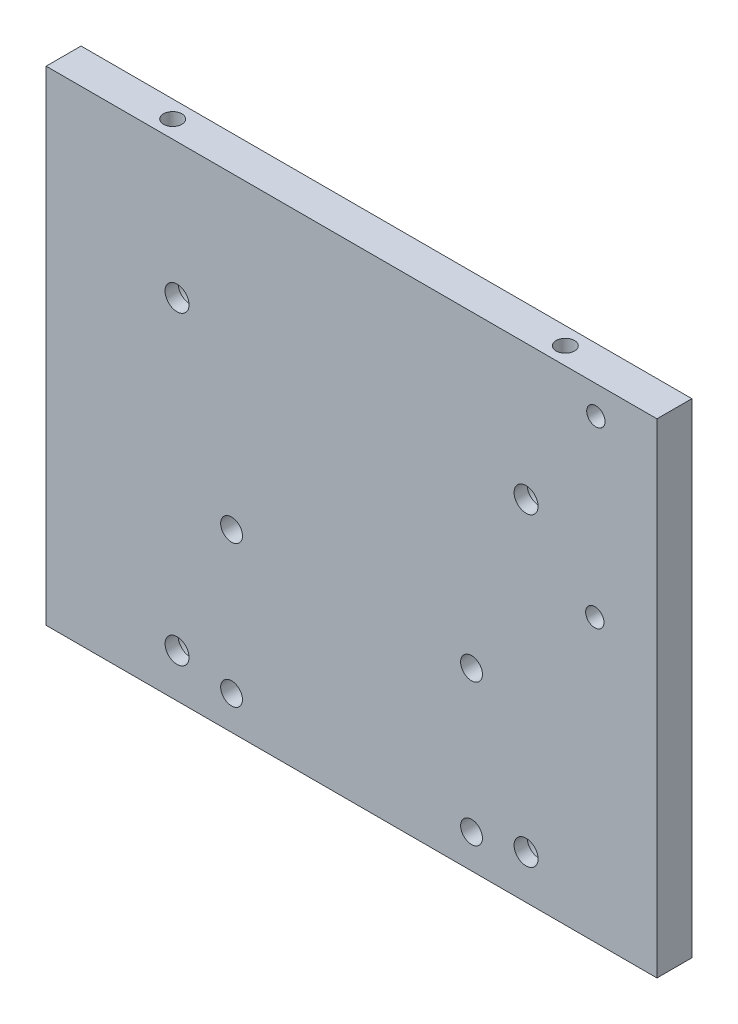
ISO-10303-21;
HEADER;
FILE_DESCRIPTION(('STEP AP214'),'2;1');
FILE_NAME('part.step','',(''),(''),'','','');
FILE_SCHEMA(('AUTOMOTIVE_DESIGN { 1 0 10303 214 1 1 1 1 }'));
ENDSEC;
DATA;
#1=APPLICATION_CONTEXT('core data for automotive mechanical design processes');
#2=APPLICATION_PROTOCOL_DEFINITION('international standard','automotive_design',2000,#1);
#3=PRODUCT_CONTEXT('',#1,'mechanical');
#4=PRODUCT('Part','Part','',(#3));
#5=PRODUCT_RELATED_PRODUCT_CATEGORY('part','',(#4));
#6=PRODUCT_DEFINITION_FORMATION('','',#4);
#7=PRODUCT_DEFINITION_CONTEXT('part definition',#1,'design');
#8=PRODUCT_DEFINITION('design','',#6,#7);
#9=PRODUCT_DEFINITION_SHAPE('','',#8);
#10=(LENGTH_UNIT() NAMED_UNIT(*) SI_UNIT(.MILLI.,.METRE.));
#11=(NAMED_UNIT(*) PLANE_ANGLE_UNIT() SI_UNIT($,.RADIAN.));
#12=(NAMED_UNIT(*) SI_UNIT($,.STERADIAN.) SOLID_ANGLE_UNIT());
#13=UNCERTAINTY_MEASURE_WITH_UNIT(LENGTH_MEASURE(1.E-05),#10,'distance_accuracy_value','');
#14=(GEOMETRIC_REPRESENTATION_CONTEXT(3) GLOBAL_UNCERTAINTY_ASSIGNED_CONTEXT((#13)) GLOBAL_UNIT_ASSIGNED_CONTEXT((#10,
#11,#12)) REPRESENTATION_CONTEXT('',''));
#15=CARTESIAN_POINT('',(0.,0.,0.));
#16=DIRECTION('',(0.,0.,1.));
#17=DIRECTION('',(1.,0.,0.));
#18=AXIS2_PLACEMENT_3D('',#15,#16,#17);
#19=CARTESIAN_POINT('',(-70.,0.,8.00000000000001));
#20=DIRECTION('',(0.,0.,1.));
#21=DIRECTION('',(1.,0.,0.));
#22=AXIS2_PLACEMENT_3D('',#19,#20,#21);
#23=PLANE('',#22);
#24=CARTESIAN_POINT('',(55.7566542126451,64.4999999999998,8.00000000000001));
#25=DIRECTION('',(0.,0.,-1.));
#26=DIRECTION('',(-1.,0.,0.));
#27=AXIS2_PLACEMENT_3D('',#24,#25,#26);
#28=CIRCLE('',#27,2.1);
#29=CARTESIAN_POINT('',(53.6566542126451,64.4999999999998,8.00000000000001));
#30=VERTEX_POINT('',#29);
#31=EDGE_CURVE('E412',#30,#30,#28,.T.);
#32=ORIENTED_EDGE('',*,*,#31,.T.);
#33=EDGE_LOOP('',(#32));
#34=FACE_BOUND('',#33,.T.);
#35=CARTESIAN_POINT('',(-40.,80.0000000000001,8.00000000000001));
#36=DIRECTION('',(0.,0.,1.));
#37=DIRECTION('',(1.,0.,0.));
#38=AXIS2_PLACEMENT_3D('',#35,#36,#37);
#39=CIRCLE('',#38,2.75);
#40=CARTESIAN_POINT('',(-37.25,80.0000000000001,8.00000000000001));
#41=VERTEX_POINT('',#40);
#42=EDGE_CURVE('E352',#41,#41,#39,.T.);
#43=ORIENTED_EDGE('',*,*,#42,.F.);
#44=EDGE_LOOP('',(#43));
#45=FACE_BOUND('',#44,.T.);
#46=CARTESIAN_POINT('',(-40.,10.,8.00000000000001));
#47=DIRECTION('',(0.,0.,1.));
#48=DIRECTION('',(1.,0.,0.));
#49=AXIS2_PLACEMENT_3D('',#46,#47,#48);
#50=CIRCLE('',#49,2.75);
#51=CARTESIAN_POINT('',(-37.25,10.,8.00000000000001));
#52=VERTEX_POINT('',#51);
#53=EDGE_CURVE('E439',#52,#52,#50,.T.);
#54=ORIENTED_EDGE('',*,*,#53,.F.);
#55=EDGE_LOOP('',(#54));
#56=FACE_BOUND('',#55,.T.);
#57=CARTESIAN_POINT('',(40.,80.0000000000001,8.00000000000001));
#58=DIRECTION('',(0.,0.,1.));
#59=DIRECTION('',(1.,0.,0.));
#60=AXIS2_PLACEMENT_3D('',#57,#58,#59);
#61=CIRCLE('',#60,2.75);
#62=CARTESIAN_POINT('',(42.75,80.0000000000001,8.00000000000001));
#63=VERTEX_POINT('',#62);
#64=EDGE_CURVE('E449',#63,#63,#61,.T.);
#65=ORIENTED_EDGE('',*,*,#64,.F.);
#66=EDGE_LOOP('',(#65));
#67=FACE_BOUND('',#66,.T.);
#68=CARTESIAN_POINT('',(40.,10.,8.00000000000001));
#69=DIRECTION('',(0.,0.,1.));
#70=DIRECTION('',(1.,0.,0.));
#71=AXIS2_PLACEMENT_3D('',#68,#69,#70);
#72=CIRCLE('',#71,2.75);
#73=CARTESIAN_POINT('',(42.75,10.,8.00000000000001));
#74=VERTEX_POINT('',#73);
#75=EDGE_CURVE('E459',#74,#74,#72,.T.);
#76=ORIENTED_EDGE('',*,*,#75,.F.);
#77=EDGE_LOOP('',(#76));
#78=FACE_BOUND('',#77,.T.);
#79=CARTESIAN_POINT('',(-27.5,40.2499999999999,8.00000000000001));
#80=DIRECTION('',(0.,0.,-1.));
#81=DIRECTION('',(-1.,0.,0.));
#82=AXIS2_PLACEMENT_3D('',#79,#80,#81);
#83=CIRCLE('',#82,2.5);
#84=CARTESIAN_POINT('',(-30.,40.2499999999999,8.00000000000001));
#85=VERTEX_POINT('',#84);
#86=EDGE_CURVE('E463',#85,#85,#83,.T.);
#87=ORIENTED_EDGE('',*,*,#86,.T.);
#88=EDGE_LOOP('',(#87));
#89=FACE_BOUND('',#88,.T.);
#90=CARTESIAN_POINT('',(-27.5,7.74999999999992,8.00000000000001));
#91=DIRECTION('',(0.,0.,-1.));
#92=DIRECTION('',(-1.,0.,0.));
#93=AXIS2_PLACEMENT_3D('',#90,#91,#92);
#94=CIRCLE('',#93,2.5);
#95=CARTESIAN_POINT('',(-30.,7.74999999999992,8.00000000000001));
#96=VERTEX_POINT('',#95);
#97=EDGE_CURVE('E469',#96,#96,#94,.T.);
#98=ORIENTED_EDGE('',*,*,#97,.T.);
#99=EDGE_LOOP('',(#98));
#100=FACE_BOUND('',#99,.T.);
#101=CARTESIAN_POINT('',(27.5,7.74999999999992,8.00000000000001));
#102=DIRECTION('',(0.,0.,-1.));
#103=DIRECTION('',(-1.,0.,0.));
#104=AXIS2_PLACEMENT_3D('',#101,#102,#103);
#105=CIRCLE('',#104,2.5);
#106=CARTESIAN_POINT('',(25.,7.74999999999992,8.00000000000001));
#107=VERTEX_POINT('',#106);
#108=EDGE_CURVE('E475',#107,#107,#105,.T.);
#109=ORIENTED_EDGE('',*,*,#108,.T.);
#110=EDGE_LOOP('',(#109));
#111=FACE_BOUND('',#110,.T.);
#112=CARTESIAN_POINT('',(27.5,40.2499999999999,8.00000000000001));
#113=DIRECTION('',(0.,0.,-1.));
#114=DIRECTION('',(-1.,0.,0.));
#115=AXIS2_PLACEMENT_3D('',#112,#113,#114);
#116=CIRCLE('',#115,2.5);
#117=CARTESIAN_POINT('',(25.,40.2499999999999,8.00000000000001));
#118=VERTEX_POINT('',#117);
#119=EDGE_CURVE('E481',#118,#118,#116,.T.);
#120=ORIENTED_EDGE('',*,*,#119,.T.);
#121=EDGE_LOOP('',(#120));
#122=FACE_BOUND('',#121,.T.);
#123=DIRECTION('',(0.,-1.,0.));
#124=VECTOR('',#123,1.);
#125=CARTESIAN_POINT('',(-70.,111.,8.00000000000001));
#126=LINE('',#125,#124);
#127=CARTESIAN_POINT('',(-70.,111.,8.00000000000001));
#128=VERTEX_POINT('',#127);
#129=CARTESIAN_POINT('',(-70.,0.,8.00000000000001));
#130=VERTEX_POINT('',#129);
#131=EDGE_CURVE('E493',#128,#130,#126,.T.);
#132=ORIENTED_EDGE('',*,*,#131,.T.);
#133=DIRECTION('',(1.,0.,0.));
#134=VECTOR('',#133,1.);
#135=CARTESIAN_POINT('',(-70.,0.,8.00000000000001));
#136=LINE('',#135,#134);
#137=CARTESIAN_POINT('',(70.,0.,8.00000000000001));
#138=VERTEX_POINT('',#137);
#139=EDGE_CURVE('E495',#130,#138,#136,.T.);
#140=ORIENTED_EDGE('',*,*,#139,.T.);
#141=DIRECTION('',(0.,1.,0.));
#142=VECTOR('',#141,1.);
#143=CARTESIAN_POINT('',(70.,111.,8.00000000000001));
#144=LINE('',#143,#142);
#145=CARTESIAN_POINT('',(70.,111.,8.00000000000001));
#146=VERTEX_POINT('',#145);
#147=EDGE_CURVE('E370',#138,#146,#144,.T.);
#148=ORIENTED_EDGE('',*,*,#147,.T.);
#149=DIRECTION('',(-1.,0.,0.));
#150=VECTOR('',#149,1.);
#151=CARTESIAN_POINT('',(-70.,111.,8.00000000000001));
#152=LINE('',#151,#150);
#153=EDGE_CURVE('E365',#146,#128,#152,.T.);
#154=ORIENTED_EDGE('',*,*,#153,.T.);
#155=EDGE_LOOP('',(#132,#140,#148,#154));
#156=FACE_BOUND('',#155,.T.);
#157=CARTESIAN_POINT('',(56.,104.5,8.00000000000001));
#158=DIRECTION('',(0.,0.,-1.));
#159=DIRECTION('',(-1.,0.,0.));
#160=AXIS2_PLACEMENT_3D('',#157,#158,#159);
#161=CIRCLE('',#160,2.1);
#162=CARTESIAN_POINT('',(53.9,104.5,8.00000000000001));
#163=VERTEX_POINT('',#162);
#164=EDGE_CURVE('E536',#163,#163,#161,.T.);
#165=ORIENTED_EDGE('',*,*,#164,.T.);
#166=EDGE_LOOP('',(#165));
#167=FACE_BOUND('',#166,.T.);
#168=ADVANCED_FACE('F348',(#34,#45,#56,#67,#78,#89,#100,#111,#122,#156,#167),#23,.T.);
#169=CARTESIAN_POINT('',(-70.,111.,8.00000000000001));
#170=DIRECTION('',(1.,0.,0.));
#171=DIRECTION('',(0.,1.,0.));
#172=AXIS2_PLACEMENT_3D('',#169,#170,#171);
#173=PLANE('',#172);
#174=DIRECTION('',(0.,-1.,0.));
#175=VECTOR('',#174,1.);
#176=CARTESIAN_POINT('',(-70.,111.,0.));
#177=LINE('',#176,#175);
#178=CARTESIAN_POINT('',(-70.,111.,0.));
#179=VERTEX_POINT('',#178);
#180=CARTESIAN_POINT('',(-70.,0.,0.));
#181=VERTEX_POINT('',#180);
#182=EDGE_CURVE('E484',#179,#181,#177,.T.);
#183=ORIENTED_EDGE('',*,*,#182,.T.);
#184=DIRECTION('',(0.,0.,-1.));
#185=VECTOR('',#184,1.);
#186=CARTESIAN_POINT('',(-70.,0.,8.00000000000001));
#187=LINE('',#186,#185);
#188=EDGE_CURVE('E11',#130,#181,#187,.T.);
#189=ORIENTED_EDGE('',*,*,#188,.F.);
#190=ORIENTED_EDGE('',*,*,#131,.F.);
#191=DIRECTION('',(0.,0.,-1.));
#192=VECTOR('',#191,1.);
#193=CARTESIAN_POINT('',(-70.,111.,8.00000000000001));
#194=LINE('',#193,#192);
#195=EDGE_CURVE('E499',#128,#179,#194,.T.);
#196=ORIENTED_EDGE('',*,*,#195,.T.);
#197=EDGE_LOOP('',(#183,#189,#190,#196));
#198=FACE_BOUND('',#197,.T.);
#199=ADVANCED_FACE('F350',(#198),#173,.F.);
#200=CARTESIAN_POINT('',(-70.,0.,8.00000000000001));
#201=DIRECTION('',(0.,1.,0.));
#202=DIRECTION('',(0.,0.,1.));
#203=AXIS2_PLACEMENT_3D('',#200,#201,#202);
#204=PLANE('',#203);
#205=DIRECTION('',(1.,0.,0.));
#206=VECTOR('',#205,1.);
#207=CARTESIAN_POINT('',(-70.,0.,0.));
#208=LINE('',#207,#206);
#209=CARTESIAN_POINT('',(70.,0.,0.));
#210=VERTEX_POINT('',#209);
#211=EDGE_CURVE('E487',#181,#210,#208,.T.);
#212=ORIENTED_EDGE('',*,*,#211,.T.);
#213=DIRECTION('',(0.,0.,-1.));
#214=VECTOR('',#213,1.);
#215=CARTESIAN_POINT('',(70.,0.,8.00000000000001));
#216=LINE('',#215,#214);
#217=EDGE_CURVE('E357',#138,#210,#216,.T.);
#218=ORIENTED_EDGE('',*,*,#217,.F.);
#219=ORIENTED_EDGE('',*,*,#139,.F.);
#220=ORIENTED_EDGE('',*,*,#188,.T.);
#221=EDGE_LOOP('',(#212,#218,#219,#220));
#222=FACE_BOUND('',#221,.T.);
#223=ADVANCED_FACE('F584',(#222),#204,.F.);
#224=CARTESIAN_POINT('',(70.,111.,8.00000000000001));
#225=DIRECTION('',(-1.,0.,0.));
#226=DIRECTION('',(0.,-1.,0.));
#227=AXIS2_PLACEMENT_3D('',#224,#225,#226);
#228=PLANE('',#227);
#229=DIRECTION('',(0.,1.,0.));
#230=VECTOR('',#229,1.);
#231=CARTESIAN_POINT('',(70.,111.,0.));
#232=LINE('',#231,#230);
#233=CARTESIAN_POINT('',(70.,111.,0.));
#234=VERTEX_POINT('',#233);
#235=EDGE_CURVE('E489',#210,#234,#232,.T.);
#236=ORIENTED_EDGE('',*,*,#235,.T.);
#237=DIRECTION('',(0.,0.,-1.));
#238=VECTOR('',#237,1.);
#239=CARTESIAN_POINT('',(70.,111.,8.00000000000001));
#240=LINE('',#239,#238);
#241=EDGE_CURVE('E502',#146,#234,#240,.T.);
#242=ORIENTED_EDGE('',*,*,#241,.F.);
#243=ORIENTED_EDGE('',*,*,#147,.F.);
#244=ORIENTED_EDGE('',*,*,#217,.T.);
#245=EDGE_LOOP('',(#236,#242,#243,#244));
#246=FACE_BOUND('',#245,.T.);
#247=ADVANCED_FACE('F581',(#246),#228,.F.);
#248=CARTESIAN_POINT('',(-70.,111.,8.00000000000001));
#249=DIRECTION('',(0.,-1.,0.));
#250=DIRECTION('',(0.,0.,-1.));
#251=AXIS2_PLACEMENT_3D('',#248,#249,#250);
#252=PLANE('',#251);
#253=CARTESIAN_POINT('',(45.,111.,4.));
#254=DIRECTION('',(0.,1.,0.));
#255=DIRECTION('',(0.,0.,1.));
#256=AXIS2_PLACEMENT_3D('',#253,#254,#255);
#257=CIRCLE('',#256,2.09999999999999);
#258=CARTESIAN_POINT('',(45.,111.,6.09999999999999));
#259=VERTEX_POINT('',#258);
#260=EDGE_CURVE('E405',#259,#259,#257,.T.);
#261=ORIENTED_EDGE('',*,*,#260,.F.);
#262=EDGE_LOOP('',(#261));
#263=FACE_BOUND('',#262,.T.);
#264=CARTESIAN_POINT('',(-45.,111.,4.));
#265=DIRECTION('',(0.,1.,0.));
#266=DIRECTION('',(0.,0.,1.));
#267=AXIS2_PLACEMENT_3D('',#264,#265,#266);
#268=CIRCLE('',#267,2.09999999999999);
#269=CARTESIAN_POINT('',(-45.,111.,6.09999999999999));
#270=VERTEX_POINT('',#269);
#271=EDGE_CURVE('E418',#270,#270,#268,.T.);
#272=ORIENTED_EDGE('',*,*,#271,.F.);
#273=EDGE_LOOP('',(#272));
#274=FACE_BOUND('',#273,.T.);
#275=DIRECTION('',(-1.,0.,0.));
#276=VECTOR('',#275,1.);
#277=CARTESIAN_POINT('',(-70.,111.,0.));
#278=LINE('',#277,#276);
#279=EDGE_CURVE('E491',#234,#179,#278,.T.);
#280=ORIENTED_EDGE('',*,*,#279,.T.);
#281=ORIENTED_EDGE('',*,*,#195,.F.);
#282=ORIENTED_EDGE('',*,*,#153,.F.);
#283=ORIENTED_EDGE('',*,*,#241,.T.);
#284=EDGE_LOOP('',(#280,#281,#282,#283));
#285=FACE_BOUND('',#284,.T.);
#286=ADVANCED_FACE('F556',(#263,#274,#285),#252,.F.);
#287=CARTESIAN_POINT('',(-70.,0.,0.));
#288=DIRECTION('',(0.,0.,1.));
#289=DIRECTION('',(1.,0.,0.));
#290=AXIS2_PLACEMENT_3D('',#287,#288,#289);
#291=PLANE('',#290);
#292=CARTESIAN_POINT('',(56.,104.5,0.));
#293=DIRECTION('',(0.,0.,-1.));
#294=DIRECTION('',(-1.,0.,0.));
#295=AXIS2_PLACEMENT_3D('',#292,#293,#294);
#296=CIRCLE('',#295,2.1);
#297=CARTESIAN_POINT('',(53.9,104.5,0.));
#298=VERTEX_POINT('',#297);
#299=EDGE_CURVE('E538',#298,#298,#296,.T.);
#300=ORIENTED_EDGE('',*,*,#299,.F.);
#301=EDGE_LOOP('',(#300));
#302=FACE_BOUND('',#301,.T.);
#303=CARTESIAN_POINT('',(55.7566542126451,64.4999999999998,0.));
#304=DIRECTION('',(0.,0.,-1.));
#305=DIRECTION('',(-1.,0.,0.));
#306=AXIS2_PLACEMENT_3D('',#303,#304,#305);
#307=CIRCLE('',#306,2.1);
#308=CARTESIAN_POINT('',(53.6566542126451,64.4999999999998,0.));
#309=VERTEX_POINT('',#308);
#310=EDGE_CURVE('E406',#309,#309,#307,.T.);
#311=ORIENTED_EDGE('',*,*,#310,.F.);
#312=EDGE_LOOP('',(#311));
#313=FACE_BOUND('',#312,.T.);
#314=CARTESIAN_POINT('',(-40.,80.0000000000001,0.));
#315=DIRECTION('',(0.,0.,-1.));
#316=DIRECTION('',(-1.,0.,0.));
#317=AXIS2_PLACEMENT_3D('',#314,#315,#316);
#318=CIRCLE('',#317,5.);
#319=CARTESIAN_POINT('',(-45.,80.0000000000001,0.));
#320=VERTEX_POINT('',#319);
#321=EDGE_CURVE('E427',#320,#320,#318,.T.);
#322=ORIENTED_EDGE('',*,*,#321,.F.);
#323=EDGE_LOOP('',(#322));
#324=FACE_BOUND('',#323,.T.);
#325=CARTESIAN_POINT('',(-40.,10.,0.));
#326=DIRECTION('',(0.,0.,-1.));
#327=DIRECTION('',(-1.,0.,0.));
#328=AXIS2_PLACEMENT_3D('',#325,#326,#327);
#329=CIRCLE('',#328,5.);
#330=CARTESIAN_POINT('',(-45.,10.,0.));
#331=VERTEX_POINT('',#330);
#332=EDGE_CURVE('E436',#331,#331,#329,.T.);
#333=ORIENTED_EDGE('',*,*,#332,.F.);
#334=EDGE_LOOP('',(#333));
#335=FACE_BOUND('',#334,.T.);
#336=CARTESIAN_POINT('',(40.,80.0000000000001,0.));
#337=DIRECTION('',(0.,0.,-1.));
#338=DIRECTION('',(-1.,0.,0.));
#339=AXIS2_PLACEMENT_3D('',#336,#337,#338);
#340=CIRCLE('',#339,5.);
#341=CARTESIAN_POINT('',(35.,80.0000000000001,0.));
#342=VERTEX_POINT('',#341);
#343=EDGE_CURVE('E446',#342,#342,#340,.T.);
#344=ORIENTED_EDGE('',*,*,#343,.F.);
#345=EDGE_LOOP('',(#344));
#346=FACE_BOUND('',#345,.T.);
#347=CARTESIAN_POINT('',(40.,10.,0.));
#348=DIRECTION('',(0.,0.,-1.));
#349=DIRECTION('',(-1.,0.,0.));
#350=AXIS2_PLACEMENT_3D('',#347,#348,#349);
#351=CIRCLE('',#350,5.);
#352=CARTESIAN_POINT('',(35.,10.,0.));
#353=VERTEX_POINT('',#352);
#354=EDGE_CURVE('E456',#353,#353,#351,.T.);
#355=ORIENTED_EDGE('',*,*,#354,.F.);
#356=EDGE_LOOP('',(#355));
#357=FACE_BOUND('',#356,.T.);
#358=CARTESIAN_POINT('',(-27.5,40.2499999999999,0.));
#359=DIRECTION('',(0.,0.,-1.));
#360=DIRECTION('',(-1.,0.,0.));
#361=AXIS2_PLACEMENT_3D('',#358,#359,#360);
#362=CIRCLE('',#361,2.49999999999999);
#363=CARTESIAN_POINT('',(-30.,40.2499999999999,0.));
#364=VERTEX_POINT('',#363);
#365=EDGE_CURVE('E460',#364,#364,#362,.T.);
#366=ORIENTED_EDGE('',*,*,#365,.F.);
#367=EDGE_LOOP('',(#366));
#368=FACE_BOUND('',#367,.T.);
#369=CARTESIAN_POINT('',(-27.5,7.74999999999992,0.));
#370=DIRECTION('',(0.,0.,-1.));
#371=DIRECTION('',(-1.,0.,0.));
#372=AXIS2_PLACEMENT_3D('',#369,#370,#371);
#373=CIRCLE('',#372,2.49999999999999);
#374=CARTESIAN_POINT('',(-30.,7.74999999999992,0.));
#375=VERTEX_POINT('',#374);
#376=EDGE_CURVE('E466',#375,#375,#373,.T.);
#377=ORIENTED_EDGE('',*,*,#376,.F.);
#378=EDGE_LOOP('',(#377));
#379=FACE_BOUND('',#378,.T.);
#380=CARTESIAN_POINT('',(27.5,7.74999999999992,0.));
#381=DIRECTION('',(0.,0.,-1.));
#382=DIRECTION('',(-1.,0.,0.));
#383=AXIS2_PLACEMENT_3D('',#380,#381,#382);
#384=CIRCLE('',#383,2.49999999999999);
#385=CARTESIAN_POINT('',(25.,7.74999999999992,0.));
#386=VERTEX_POINT('',#385);
#387=EDGE_CURVE('E472',#386,#386,#384,.T.);
#388=ORIENTED_EDGE('',*,*,#387,.F.);
#389=EDGE_LOOP('',(#388));
#390=FACE_BOUND('',#389,.T.);
#391=CARTESIAN_POINT('',(27.5,40.2499999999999,0.));
#392=DIRECTION('',(0.,0.,-1.));
#393=DIRECTION('',(-1.,0.,0.));
#394=AXIS2_PLACEMENT_3D('',#391,#392,#393);
#395=CIRCLE('',#394,2.49999999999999);
#396=CARTESIAN_POINT('',(25.,40.2499999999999,0.));
#397=VERTEX_POINT('',#396);
#398=EDGE_CURVE('E478',#397,#397,#395,.T.);
#399=ORIENTED_EDGE('',*,*,#398,.F.);
#400=EDGE_LOOP('',(#399));
#401=FACE_BOUND('',#400,.T.);
#402=ORIENTED_EDGE('',*,*,#182,.F.);
#403=ORIENTED_EDGE('',*,*,#279,.F.);
#404=ORIENTED_EDGE('',*,*,#235,.F.);
#405=ORIENTED_EDGE('',*,*,#211,.F.);
#406=EDGE_LOOP('',(#402,#403,#404,#405));
#407=FACE_BOUND('',#406,.T.);
#408=ADVANCED_FACE('F552',(#302,#313,#324,#335,#346,#357,#368,#379,#390,#401,#407),#291,.F.);
#409=CARTESIAN_POINT('',(27.5,40.2499999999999,0.));
#410=DIRECTION('',(0.,0.,-1.));
#411=DIRECTION('',(-1.,0.,0.));
#412=AXIS2_PLACEMENT_3D('',#409,#410,#411);
#413=CYLINDRICAL_SURFACE('',#412,2.49999999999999);
#414=ORIENTED_EDGE('',*,*,#119,.F.);
#415=EDGE_LOOP('',(#414));
#416=FACE_BOUND('',#415,.T.);
#417=ORIENTED_EDGE('',*,*,#398,.T.);
#418=EDGE_LOOP('',(#417));
#419=FACE_BOUND('',#418,.T.);
#420=ADVANCED_FACE('F555',(#416,#419),#413,.F.);
#421=CARTESIAN_POINT('',(27.5,7.74999999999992,0.));
#422=DIRECTION('',(0.,0.,-1.));
#423=DIRECTION('',(-1.,0.,0.));
#424=AXIS2_PLACEMENT_3D('',#421,#422,#423);
#425=CYLINDRICAL_SURFACE('',#424,2.49999999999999);
#426=ORIENTED_EDGE('',*,*,#108,.F.);
#427=EDGE_LOOP('',(#426));
#428=FACE_BOUND('',#427,.T.);
#429=ORIENTED_EDGE('',*,*,#387,.T.);
#430=EDGE_LOOP('',(#429));
#431=FACE_BOUND('',#430,.T.);
#432=ADVANCED_FACE('F597',(#428,#431),#425,.F.);
#433=CARTESIAN_POINT('',(-27.5,7.74999999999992,0.));
#434=DIRECTION('',(0.,0.,-1.));
#435=DIRECTION('',(-1.,0.,0.));
#436=AXIS2_PLACEMENT_3D('',#433,#434,#435);
#437=CYLINDRICAL_SURFACE('',#436,2.49999999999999);
#438=ORIENTED_EDGE('',*,*,#97,.F.);
#439=EDGE_LOOP('',(#438));
#440=FACE_BOUND('',#439,.T.);
#441=ORIENTED_EDGE('',*,*,#376,.T.);
#442=EDGE_LOOP('',(#441));
#443=FACE_BOUND('',#442,.T.);
#444=ADVANCED_FACE('F601',(#440,#443),#437,.F.);
#445=CARTESIAN_POINT('',(-27.5,40.2499999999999,0.));
#446=DIRECTION('',(0.,0.,-1.));
#447=DIRECTION('',(-1.,0.,0.));
#448=AXIS2_PLACEMENT_3D('',#445,#446,#447);
#449=CYLINDRICAL_SURFACE('',#448,2.49999999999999);
#450=ORIENTED_EDGE('',*,*,#86,.F.);
#451=EDGE_LOOP('',(#450));
#452=FACE_BOUND('',#451,.T.);
#453=ORIENTED_EDGE('',*,*,#365,.T.);
#454=EDGE_LOOP('',(#453));
#455=FACE_BOUND('',#454,.T.);
#456=ADVANCED_FACE('F605',(#452,#455),#449,.F.);
#457=CARTESIAN_POINT('',(40.,10.,0.));
#458=DIRECTION('',(0.,0.,-1.));
#459=DIRECTION('',(-1.,0.,0.));
#460=AXIS2_PLACEMENT_3D('',#457,#458,#459);
#461=CYLINDRICAL_SURFACE('',#460,5.);
#462=CARTESIAN_POINT('',(40.,10.,5.));
#463=DIRECTION('',(0.,0.,-1.));
#464=DIRECTION('',(-1.,0.,0.));
#465=AXIS2_PLACEMENT_3D('',#462,#463,#464);
#466=CIRCLE('',#465,5.);
#467=CARTESIAN_POINT('',(35.,10.,5.));
#468=VERTEX_POINT('',#467);
#469=EDGE_CURVE('E453',#468,#468,#466,.T.);
#470=ORIENTED_EDGE('',*,*,#469,.F.);
#471=EDGE_LOOP('',(#470));
#472=FACE_BOUND('',#471,.T.);
#473=ORIENTED_EDGE('',*,*,#354,.T.);
#474=EDGE_LOOP('',(#473));
#475=FACE_BOUND('',#474,.T.);
#476=ADVANCED_FACE('F609',(#472,#475),#461,.F.);
#477=CARTESIAN_POINT('',(42.75,10.,5.));
#478=DIRECTION('',(0.,0.,1.));
#479=DIRECTION('',(1.,0.,0.));
#480=AXIS2_PLACEMENT_3D('',#477,#478,#479);
#481=PLANE('',#480);
#482=CARTESIAN_POINT('',(40.,10.,5.));
#483=DIRECTION('',(0.,0.,-1.));
#484=DIRECTION('',(-1.,0.,0.));
#485=AXIS2_PLACEMENT_3D('',#482,#483,#484);
#486=CIRCLE('',#485,2.75);
#487=CARTESIAN_POINT('',(37.25,10.,5.));
#488=VERTEX_POINT('',#487);
#489=EDGE_CURVE('E450',#488,#488,#486,.T.);
#490=ORIENTED_EDGE('',*,*,#489,.F.);
#491=EDGE_LOOP('',(#490));
#492=FACE_BOUND('',#491,.T.);
#493=ORIENTED_EDGE('',*,*,#469,.T.);
#494=EDGE_LOOP('',(#493));
#495=FACE_BOUND('',#494,.T.);
#496=ADVANCED_FACE('F613',(#492,#495),#481,.F.);
#497=CARTESIAN_POINT('',(40.,10.,0.));
#498=DIRECTION('',(0.,0.,-1.));
#499=DIRECTION('',(-1.,0.,0.));
#500=AXIS2_PLACEMENT_3D('',#497,#498,#499);
#501=CYLINDRICAL_SURFACE('',#500,2.75);
#502=ORIENTED_EDGE('',*,*,#75,.T.);
#503=EDGE_LOOP('',(#502));
#504=FACE_BOUND('',#503,.T.);
#505=ORIENTED_EDGE('',*,*,#489,.T.);
#506=EDGE_LOOP('',(#505));
#507=FACE_BOUND('',#506,.T.);
#508=ADVANCED_FACE('F617',(#504,#507),#501,.F.);
#509=CARTESIAN_POINT('',(40.,80.0000000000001,0.));
#510=DIRECTION('',(0.,0.,-1.));
#511=DIRECTION('',(-1.,0.,0.));
#512=AXIS2_PLACEMENT_3D('',#509,#510,#511);
#513=CYLINDRICAL_SURFACE('',#512,5.);
#514=CARTESIAN_POINT('',(40.,80.0000000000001,5.));
#515=DIRECTION('',(0.,0.,-1.));
#516=DIRECTION('',(-1.,0.,0.));
#517=AXIS2_PLACEMENT_3D('',#514,#515,#516);
#518=CIRCLE('',#517,5.);
#519=CARTESIAN_POINT('',(35.,80.0000000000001,5.));
#520=VERTEX_POINT('',#519);
#521=EDGE_CURVE('E443',#520,#520,#518,.T.);
#522=ORIENTED_EDGE('',*,*,#521,.F.);
#523=EDGE_LOOP('',(#522));
#524=FACE_BOUND('',#523,.T.);
#525=ORIENTED_EDGE('',*,*,#343,.T.);
#526=EDGE_LOOP('',(#525));
#527=FACE_BOUND('',#526,.T.);
#528=ADVANCED_FACE('F621',(#524,#527),#513,.F.);
#529=CARTESIAN_POINT('',(42.75,80.0000000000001,5.));
#530=DIRECTION('',(0.,0.,1.));
#531=DIRECTION('',(1.,0.,0.));
#532=AXIS2_PLACEMENT_3D('',#529,#530,#531);
#533=PLANE('',#532);
#534=CARTESIAN_POINT('',(40.,80.0000000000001,5.));
#535=DIRECTION('',(0.,0.,-1.));
#536=DIRECTION('',(-1.,0.,0.));
#537=AXIS2_PLACEMENT_3D('',#534,#535,#536);
#538=CIRCLE('',#537,2.75);
#539=CARTESIAN_POINT('',(37.25,80.0000000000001,5.));
#540=VERTEX_POINT('',#539);
#541=EDGE_CURVE('E440',#540,#540,#538,.T.);
#542=ORIENTED_EDGE('',*,*,#541,.F.);
#543=EDGE_LOOP('',(#542));
#544=FACE_BOUND('',#543,.T.);
#545=ORIENTED_EDGE('',*,*,#521,.T.);
#546=EDGE_LOOP('',(#545));
#547=FACE_BOUND('',#546,.T.);
#548=ADVANCED_FACE('F625',(#544,#547),#533,.F.);
#549=CARTESIAN_POINT('',(40.,80.0000000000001,0.));
#550=DIRECTION('',(0.,0.,-1.));
#551=DIRECTION('',(-1.,0.,0.));
#552=AXIS2_PLACEMENT_3D('',#549,#550,#551);
#553=CYLINDRICAL_SURFACE('',#552,2.75);
#554=ORIENTED_EDGE('',*,*,#64,.T.);
#555=EDGE_LOOP('',(#554));
#556=FACE_BOUND('',#555,.T.);
#557=ORIENTED_EDGE('',*,*,#541,.T.);
#558=EDGE_LOOP('',(#557));
#559=FACE_BOUND('',#558,.T.);
#560=ADVANCED_FACE('F629',(#556,#559),#553,.F.);
#561=CARTESIAN_POINT('',(-40.,10.,0.));
#562=DIRECTION('',(0.,0.,-1.));
#563=DIRECTION('',(-1.,0.,0.));
#564=AXIS2_PLACEMENT_3D('',#561,#562,#563);
#565=CYLINDRICAL_SURFACE('',#564,5.);
#566=CARTESIAN_POINT('',(-40.,10.,5.));
#567=DIRECTION('',(0.,0.,-1.));
#568=DIRECTION('',(-1.,0.,0.));
#569=AXIS2_PLACEMENT_3D('',#566,#567,#568);
#570=CIRCLE('',#569,5.);
#571=CARTESIAN_POINT('',(-45.,10.,5.));
#572=VERTEX_POINT('',#571);
#573=EDGE_CURVE('E433',#572,#572,#570,.T.);
#574=ORIENTED_EDGE('',*,*,#573,.F.);
#575=EDGE_LOOP('',(#574));
#576=FACE_BOUND('',#575,.T.);
#577=ORIENTED_EDGE('',*,*,#332,.T.);
#578=EDGE_LOOP('',(#577));
#579=FACE_BOUND('',#578,.T.);
#580=ADVANCED_FACE('F633',(#576,#579),#565,.F.);
#581=CARTESIAN_POINT('',(-37.25,10.,5.));
#582=DIRECTION('',(0.,0.,1.));
#583=DIRECTION('',(1.,0.,0.));
#584=AXIS2_PLACEMENT_3D('',#581,#582,#583);
#585=PLANE('',#584);
#586=CARTESIAN_POINT('',(-40.,10.,5.));
#587=DIRECTION('',(0.,0.,-1.));
#588=DIRECTION('',(-1.,0.,0.));
#589=AXIS2_PLACEMENT_3D('',#586,#587,#588);
#590=CIRCLE('',#589,2.75);
#591=CARTESIAN_POINT('',(-42.75,10.,5.));
#592=VERTEX_POINT('',#591);
#593=EDGE_CURVE('E430',#592,#592,#590,.T.);
#594=ORIENTED_EDGE('',*,*,#593,.F.);
#595=EDGE_LOOP('',(#594));
#596=FACE_BOUND('',#595,.T.);
#597=ORIENTED_EDGE('',*,*,#573,.T.);
#598=EDGE_LOOP('',(#597));
#599=FACE_BOUND('',#598,.T.);
#600=ADVANCED_FACE('F637',(#596,#599),#585,.F.);
#601=CARTESIAN_POINT('',(-40.,10.,0.));
#602=DIRECTION('',(0.,0.,-1.));
#603=DIRECTION('',(-1.,0.,0.));
#604=AXIS2_PLACEMENT_3D('',#601,#602,#603);
#605=CYLINDRICAL_SURFACE('',#604,2.75);
#606=ORIENTED_EDGE('',*,*,#53,.T.);
#607=EDGE_LOOP('',(#606));
#608=FACE_BOUND('',#607,.T.);
#609=ORIENTED_EDGE('',*,*,#593,.T.);
#610=EDGE_LOOP('',(#609));
#611=FACE_BOUND('',#610,.T.);
#612=ADVANCED_FACE('F513',(#608,#611),#605,.F.);
#613=CARTESIAN_POINT('',(-40.,80.0000000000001,0.));
#614=DIRECTION('',(0.,0.,-1.));
#615=DIRECTION('',(-1.,0.,0.));
#616=AXIS2_PLACEMENT_3D('',#613,#614,#615);
#617=CYLINDRICAL_SURFACE('',#616,5.);
#618=CARTESIAN_POINT('',(-40.,80.0000000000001,5.));
#619=DIRECTION('',(0.,0.,-1.));
#620=DIRECTION('',(-1.,0.,0.));
#621=AXIS2_PLACEMENT_3D('',#618,#619,#620);
#622=CIRCLE('',#621,5.);
#623=CARTESIAN_POINT('',(-45.,80.0000000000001,5.));
#624=VERTEX_POINT('',#623);
#625=EDGE_CURVE('E424',#624,#624,#622,.T.);
#626=ORIENTED_EDGE('',*,*,#625,.F.);
#627=EDGE_LOOP('',(#626));
#628=FACE_BOUND('',#627,.T.);
#629=ORIENTED_EDGE('',*,*,#321,.T.);
#630=EDGE_LOOP('',(#629));
#631=FACE_BOUND('',#630,.T.);
#632=ADVANCED_FACE('F644',(#628,#631),#617,.F.);
#633=CARTESIAN_POINT('',(-37.25,80.0000000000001,5.));
#634=DIRECTION('',(0.,0.,1.));
#635=DIRECTION('',(1.,0.,0.));
#636=AXIS2_PLACEMENT_3D('',#633,#634,#635);
#637=PLANE('',#636);
#638=CARTESIAN_POINT('',(-40.,80.0000000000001,5.));
#639=DIRECTION('',(0.,0.,-1.));
#640=DIRECTION('',(-1.,0.,0.));
#641=AXIS2_PLACEMENT_3D('',#638,#639,#640);
#642=CIRCLE('',#641,2.75);
#643=CARTESIAN_POINT('',(-42.75,80.0000000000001,5.));
#644=VERTEX_POINT('',#643);
#645=EDGE_CURVE('E421',#644,#644,#642,.T.);
#646=ORIENTED_EDGE('',*,*,#645,.F.);
#647=EDGE_LOOP('',(#646));
#648=FACE_BOUND('',#647,.T.);
#649=ORIENTED_EDGE('',*,*,#625,.T.);
#650=EDGE_LOOP('',(#649));
#651=FACE_BOUND('',#650,.T.);
#652=ADVANCED_FACE('F647',(#648,#651),#637,.F.);
#653=CARTESIAN_POINT('',(-40.,80.0000000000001,0.));
#654=DIRECTION('',(0.,0.,-1.));
#655=DIRECTION('',(-1.,0.,0.));
#656=AXIS2_PLACEMENT_3D('',#653,#654,#655);
#657=CYLINDRICAL_SURFACE('',#656,2.75);
#658=ORIENTED_EDGE('',*,*,#42,.T.);
#659=EDGE_LOOP('',(#658));
#660=FACE_BOUND('',#659,.T.);
#661=ORIENTED_EDGE('',*,*,#645,.T.);
#662=EDGE_LOOP('',(#661));
#663=FACE_BOUND('',#662,.T.);
#664=ADVANCED_FACE('F651',(#660,#663),#657,.F.);
#665=CARTESIAN_POINT('',(-45.,111.,4.));
#666=DIRECTION('',(0.,1.,0.));
#667=DIRECTION('',(0.,0.,1.));
#668=AXIS2_PLACEMENT_3D('',#665,#666,#667);
#669=CYLINDRICAL_SURFACE('',#668,2.09999999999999);
#670=CARTESIAN_POINT('',(-45.,97.,4.));
#671=DIRECTION('',(0.,1.,0.));
#672=DIRECTION('',(0.,0.,1.));
#673=AXIS2_PLACEMENT_3D('',#670,#671,#672);
#674=CIRCLE('',#673,2.09999999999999);
#675=CARTESIAN_POINT('',(-45.,97.,6.09999999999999));
#676=VERTEX_POINT('',#675);
#677=EDGE_CURVE('E409',#676,#676,#674,.T.);
#678=ORIENTED_EDGE('',*,*,#677,.F.);
#679=EDGE_LOOP('',(#678));
#680=FACE_BOUND('',#679,.T.);
#681=ORIENTED_EDGE('',*,*,#271,.T.);
#682=EDGE_LOOP('',(#681));
#683=FACE_BOUND('',#682,.T.);
#684=ADVANCED_FACE('F655',(#680,#683),#669,.F.);
#685=CARTESIAN_POINT('',(-45.,97.,4.));
#686=DIRECTION('',(0.,1.,0.));
#687=DIRECTION('',(0.,0.,1.));
#688=AXIS2_PLACEMENT_3D('',#685,#686,#687);
#689=CONICAL_SURFACE('',#688,2.09999999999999,1.02974425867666);
#690=CARTESIAN_POINT('',(-45.,95.738192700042,4.));
#691=VERTEX_POINT('',#690);
#692=VERTEX_LOOP('',#691);
#693=FACE_BOUND('',#692,.T.);
#694=ORIENTED_EDGE('',*,*,#677,.T.);
#695=EDGE_LOOP('',(#694));
#696=FACE_BOUND('',#695,.T.);
#697=ADVANCED_FACE('F659',(#693,#696),#689,.F.);
#698=CARTESIAN_POINT('',(45.,111.,4.));
#699=DIRECTION('',(0.,1.,0.));
#700=DIRECTION('',(0.,0.,1.));
#701=AXIS2_PLACEMENT_3D('',#698,#699,#700);
#702=CYLINDRICAL_SURFACE('',#701,2.09999999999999);
#703=CARTESIAN_POINT('',(45.,97.,4.));
#704=DIRECTION('',(0.,1.,0.));
#705=DIRECTION('',(0.,0.,1.));
#706=AXIS2_PLACEMENT_3D('',#703,#704,#705);
#707=CIRCLE('',#706,2.09999999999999);
#708=CARTESIAN_POINT('',(45.,97.,6.09999999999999));
#709=VERTEX_POINT('',#708);
#710=EDGE_CURVE('E403',#709,#709,#707,.T.);
#711=ORIENTED_EDGE('',*,*,#710,.F.);
#712=EDGE_LOOP('',(#711));
#713=FACE_BOUND('',#712,.T.);
#714=ORIENTED_EDGE('',*,*,#260,.T.);
#715=EDGE_LOOP('',(#714));
#716=FACE_BOUND('',#715,.T.);
#717=ADVANCED_FACE('F399',(#713,#716),#702,.F.);
#718=CARTESIAN_POINT('',(45.,97.,4.));
#719=DIRECTION('',(0.,1.,0.));
#720=DIRECTION('',(0.,0.,1.));
#721=AXIS2_PLACEMENT_3D('',#718,#719,#720);
#722=CONICAL_SURFACE('',#721,2.09999999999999,1.02974425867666);
#723=CARTESIAN_POINT('',(45.,95.738192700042,4.));
#724=VERTEX_POINT('',#723);
#725=VERTEX_LOOP('',#724);
#726=FACE_BOUND('',#725,.T.);
#727=ORIENTED_EDGE('',*,*,#710,.T.);
#728=EDGE_LOOP('',(#727));
#729=FACE_BOUND('',#728,.T.);
#730=ADVANCED_FACE('F395',(#726,#729),#722,.F.);
#731=CARTESIAN_POINT('',(55.7566542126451,64.4999999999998,0.));
#732=DIRECTION('',(0.,0.,-1.));
#733=DIRECTION('',(-1.,0.,0.));
#734=AXIS2_PLACEMENT_3D('',#731,#732,#733);
#735=CYLINDRICAL_SURFACE('',#734,2.1);
#736=ORIENTED_EDGE('',*,*,#31,.F.);
#737=EDGE_LOOP('',(#736));
#738=FACE_BOUND('',#737,.T.);
#739=ORIENTED_EDGE('',*,*,#310,.T.);
#740=EDGE_LOOP('',(#739));
#741=FACE_BOUND('',#740,.T.);
#742=ADVANCED_FACE('F398',(#738,#741),#735,.F.);
#743=CARTESIAN_POINT('',(56.,104.5,0.));
#744=DIRECTION('',(0.,0.,-1.));
#745=DIRECTION('',(-1.,0.,0.));
#746=AXIS2_PLACEMENT_3D('',#743,#744,#745);
#747=CYLINDRICAL_SURFACE('',#746,2.1);
#748=ORIENTED_EDGE('',*,*,#164,.F.);
#749=EDGE_LOOP('',(#748));
#750=FACE_BOUND('',#749,.T.);
#751=ORIENTED_EDGE('',*,*,#299,.T.);
#752=EDGE_LOOP('',(#751));
#753=FACE_BOUND('',#752,.T.);
#754=ADVANCED_FACE('F548',(#750,#753),#747,.F.);
#755=CLOSED_SHELL('',(#168,#199,#223,#247,#286,#408,#420,#432,#444,#456,#476,#496,#508,#528,
#548,#560,#580,#600,#612,#632,#652,#664,#684,#697,#717,#730,#742,#754));
#756=MANIFOLD_SOLID_BREP('B2',#755);
#757=ADVANCED_BREP_SHAPE_REPRESENTATION('',(#18,#756),#14);
#758=SHAPE_DEFINITION_REPRESENTATION(#9,#757);
ENDSEC;
END-ISO-10303-21;
